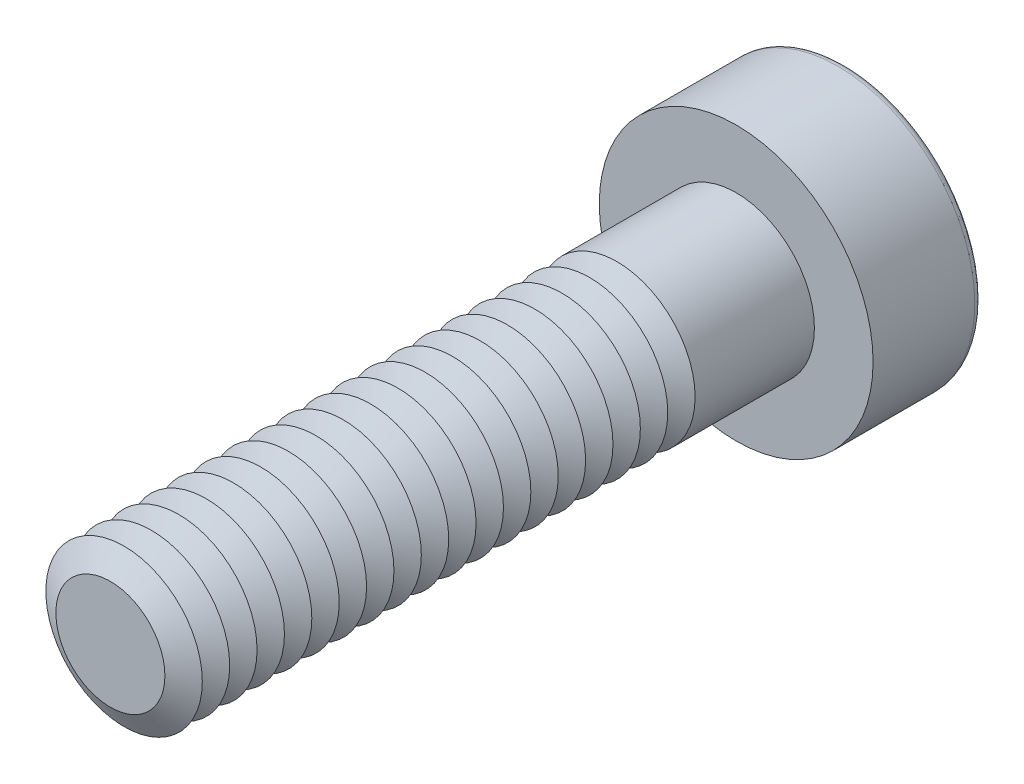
ISO-10303-21;
HEADER;
FILE_DESCRIPTION(('STEP AP214'),'2;1');
FILE_NAME('part.step','',(''),(''),'','','');
FILE_SCHEMA(('AUTOMOTIVE_DESIGN { 1 0 10303 214 1 1 1 1 }'));
ENDSEC;
DATA;
#1=APPLICATION_CONTEXT('core data for automotive mechanical design processes');
#2=APPLICATION_PROTOCOL_DEFINITION('international standard','automotive_design',2000,#1);
#3=PRODUCT_CONTEXT('',#1,'mechanical');
#4=PRODUCT('Part','Part','',(#3));
#5=PRODUCT_RELATED_PRODUCT_CATEGORY('part','',(#4));
#6=PRODUCT_DEFINITION_FORMATION('','',#4);
#7=PRODUCT_DEFINITION_CONTEXT('part definition',#1,'design');
#8=PRODUCT_DEFINITION('design','',#6,#7);
#9=PRODUCT_DEFINITION_SHAPE('','',#8);
#10=(LENGTH_UNIT() NAMED_UNIT(*) SI_UNIT(.MILLI.,.METRE.));
#11=(NAMED_UNIT(*) PLANE_ANGLE_UNIT() SI_UNIT($,.RADIAN.));
#12=(NAMED_UNIT(*) SI_UNIT($,.STERADIAN.) SOLID_ANGLE_UNIT());
#13=UNCERTAINTY_MEASURE_WITH_UNIT(LENGTH_MEASURE(1.E-05),#10,'distance_accuracy_value','');
#14=(GEOMETRIC_REPRESENTATION_CONTEXT(3) GLOBAL_UNCERTAINTY_ASSIGNED_CONTEXT((#13)) GLOBAL_UNIT_ASSIGNED_CONTEXT((#10,
#11,#12)) REPRESENTATION_CONTEXT('',''));
#15=CARTESIAN_POINT('',(0.,0.,0.));
#16=DIRECTION('',(0.,0.,1.));
#17=DIRECTION('',(1.,0.,0.));
#18=AXIS2_PLACEMENT_3D('',#15,#16,#17);
#19=CARTESIAN_POINT('',(0.,0.,13.55));
#20=DIRECTION('',(0.,0.,1.));
#21=DIRECTION('',(1.,0.,0.));
#22=AXIS2_PLACEMENT_3D('',#19,#20,#21);
#23=CONICAL_SURFACE('',#22,2.,1.0471975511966);
#24=CARTESIAN_POINT('',(0.,0.,13.2));
#25=DIRECTION('',(0.,0.,1.));
#26=DIRECTION('',(1.,0.,0.));
#27=AXIS2_PLACEMENT_3D('',#24,#25,#26);
#28=CIRCLE('',#27,1.39378221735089);
#29=CARTESIAN_POINT('',(1.39378221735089,0.,13.2));
#30=VERTEX_POINT('',#29);
#31=EDGE_CURVE('E313',#30,#30,#28,.T.);
#32=ORIENTED_EDGE('',*,*,#31,.T.);
#33=EDGE_LOOP('',(#32));
#34=FACE_BOUND('',#33,.T.);
#35=CARTESIAN_POINT('',(0.,0.,13.55));
#36=DIRECTION('',(0.,0.,1.));
#37=DIRECTION('',(1.,0.,0.));
#38=AXIS2_PLACEMENT_3D('',#35,#36,#37);
#39=CIRCLE('',#38,2.);
#40=CARTESIAN_POINT('',(2.,0.,13.55));
#41=VERTEX_POINT('',#40);
#42=EDGE_CURVE('E316',#41,#41,#39,.T.);
#43=ORIENTED_EDGE('',*,*,#42,.F.);
#44=EDGE_LOOP('',(#43));
#45=FACE_BOUND('',#44,.T.);
#46=ADVANCED_FACE('F39',(#34,#45),#23,.T.);
#47=CARTESIAN_POINT('',(0.,0.,13.2));
#48=DIRECTION('',(0.,0.,-1.));
#49=DIRECTION('',(-1.,0.,0.));
#50=AXIS2_PLACEMENT_3D('',#47,#48,#49);
#51=CONICAL_SURFACE('',#50,1.39378221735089,1.0471975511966);
#52=CARTESIAN_POINT('',(0.,0.,12.85));
#53=DIRECTION('',(0.,0.,1.));
#54=DIRECTION('',(1.,0.,0.));
#55=AXIS2_PLACEMENT_3D('',#52,#53,#54);
#56=CIRCLE('',#55,2.);
#57=CARTESIAN_POINT('',(2.,0.,12.85));
#58=VERTEX_POINT('',#57);
#59=EDGE_CURVE('E323',#58,#58,#56,.T.);
#60=ORIENTED_EDGE('',*,*,#59,.T.);
#61=EDGE_LOOP('',(#60));
#62=FACE_BOUND('',#61,.T.);
#63=ORIENTED_EDGE('',*,*,#31,.F.);
#64=EDGE_LOOP('',(#63));
#65=FACE_BOUND('',#64,.T.);
#66=ADVANCED_FACE('F245',(#62,#65),#51,.T.);
#67=CARTESIAN_POINT('',(0.,0.,16.));
#68=DIRECTION('',(0.,0.,1.));
#69=DIRECTION('',(1.,0.,0.));
#70=AXIS2_PLACEMENT_3D('',#67,#68,#69);
#71=PLANE('',#70);
#72=CARTESIAN_POINT('',(0.,0.,16.));
#73=DIRECTION('',(0.,0.,1.));
#74=DIRECTION('',(1.,0.,0.));
#75=AXIS2_PLACEMENT_3D('',#72,#73,#74);
#76=CIRCLE('',#75,1.39378221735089);
#77=CARTESIAN_POINT('',(1.39378221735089,0.,16.));
#78=VERTEX_POINT('',#77);
#79=EDGE_CURVE('E174',#78,#78,#76,.T.);
#80=ORIENTED_EDGE('',*,*,#79,.T.);
#81=EDGE_LOOP('',(#80));
#82=FACE_BOUND('',#81,.T.);
#83=ADVANCED_FACE('F251',(#82),#71,.T.);
#84=CARTESIAN_POINT('',(0.,0.,16.));
#85=DIRECTION('',(0.,0.,-1.));
#86=DIRECTION('',(-1.,0.,0.));
#87=AXIS2_PLACEMENT_3D('',#84,#85,#86);
#88=CONICAL_SURFACE('',#87,1.39378221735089,1.0471975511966);
#89=CARTESIAN_POINT('',(0.,0.,15.65));
#90=DIRECTION('',(0.,0.,1.));
#91=DIRECTION('',(1.,0.,0.));
#92=AXIS2_PLACEMENT_3D('',#89,#90,#91);
#93=CIRCLE('',#92,2.);
#94=CARTESIAN_POINT('',(2.,0.,15.65));
#95=VERTEX_POINT('',#94);
#96=EDGE_CURVE('E291',#95,#95,#93,.T.);
#97=ORIENTED_EDGE('',*,*,#96,.T.);
#98=EDGE_LOOP('',(#97));
#99=FACE_BOUND('',#98,.T.);
#100=ORIENTED_EDGE('',*,*,#79,.F.);
#101=EDGE_LOOP('',(#100));
#102=FACE_BOUND('',#101,.T.);
#103=ADVANCED_FACE('F199',(#99,#102),#88,.T.);
#104=CARTESIAN_POINT('',(0.,0.,15.65));
#105=DIRECTION('',(0.,0.,1.));
#106=DIRECTION('',(1.,0.,0.));
#107=AXIS2_PLACEMENT_3D('',#104,#105,#106);
#108=CONICAL_SURFACE('',#107,2.,1.0471975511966);
#109=CARTESIAN_POINT('',(0.,0.,15.3));
#110=DIRECTION('',(0.,0.,1.));
#111=DIRECTION('',(1.,0.,0.));
#112=AXIS2_PLACEMENT_3D('',#109,#110,#111);
#113=CIRCLE('',#112,1.39378221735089);
#114=CARTESIAN_POINT('',(1.39378221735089,0.,15.3));
#115=VERTEX_POINT('',#114);
#116=EDGE_CURVE('E288',#115,#115,#113,.T.);
#117=ORIENTED_EDGE('',*,*,#116,.T.);
#118=EDGE_LOOP('',(#117));
#119=FACE_BOUND('',#118,.T.);
#120=ORIENTED_EDGE('',*,*,#96,.F.);
#121=EDGE_LOOP('',(#120));
#122=FACE_BOUND('',#121,.T.);
#123=ADVANCED_FACE('F277',(#119,#122),#108,.T.);
#124=CARTESIAN_POINT('',(0.,0.,15.3));
#125=DIRECTION('',(0.,0.,-1.));
#126=DIRECTION('',(-1.,0.,0.));
#127=AXIS2_PLACEMENT_3D('',#124,#125,#126);
#128=CONICAL_SURFACE('',#127,1.39378221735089,1.0471975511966);
#129=CARTESIAN_POINT('',(0.,0.,14.95));
#130=DIRECTION('',(0.,0.,1.));
#131=DIRECTION('',(1.,0.,0.));
#132=AXIS2_PLACEMENT_3D('',#129,#130,#131);
#133=CIRCLE('',#132,2.);
#134=CARTESIAN_POINT('',(2.,0.,14.95));
#135=VERTEX_POINT('',#134);
#136=EDGE_CURVE('E299',#135,#135,#133,.T.);
#137=ORIENTED_EDGE('',*,*,#136,.T.);
#138=EDGE_LOOP('',(#137));
#139=FACE_BOUND('',#138,.T.);
#140=ORIENTED_EDGE('',*,*,#116,.F.);
#141=EDGE_LOOP('',(#140));
#142=FACE_BOUND('',#141,.T.);
#143=ADVANCED_FACE('F274',(#139,#142),#128,.T.);
#144=CARTESIAN_POINT('',(0.,0.,14.95));
#145=DIRECTION('',(0.,0.,1.));
#146=DIRECTION('',(1.,0.,0.));
#147=AXIS2_PLACEMENT_3D('',#144,#145,#146);
#148=CONICAL_SURFACE('',#147,2.,1.0471975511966);
#149=CARTESIAN_POINT('',(0.,0.,14.6));
#150=DIRECTION('',(0.,0.,1.));
#151=DIRECTION('',(1.,0.,0.));
#152=AXIS2_PLACEMENT_3D('',#149,#150,#151);
#153=CIRCLE('',#152,1.39378221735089);
#154=CARTESIAN_POINT('',(1.39378221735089,0.,14.6));
#155=VERTEX_POINT('',#154);
#156=EDGE_CURVE('E293',#155,#155,#153,.T.);
#157=ORIENTED_EDGE('',*,*,#156,.T.);
#158=EDGE_LOOP('',(#157));
#159=FACE_BOUND('',#158,.T.);
#160=ORIENTED_EDGE('',*,*,#136,.F.);
#161=EDGE_LOOP('',(#160));
#162=FACE_BOUND('',#161,.T.);
#163=ADVANCED_FACE('F270',(#159,#162),#148,.T.);
#164=CARTESIAN_POINT('',(0.,0.,14.6));
#165=DIRECTION('',(0.,0.,-1.));
#166=DIRECTION('',(-1.,0.,0.));
#167=AXIS2_PLACEMENT_3D('',#164,#165,#166);
#168=CONICAL_SURFACE('',#167,1.39378221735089,1.0471975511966);
#169=CARTESIAN_POINT('',(0.,0.,14.25));
#170=DIRECTION('',(0.,0.,1.));
#171=DIRECTION('',(1.,0.,0.));
#172=AXIS2_PLACEMENT_3D('',#169,#170,#171);
#173=CIRCLE('',#172,2.);
#174=CARTESIAN_POINT('',(2.,0.,14.25));
#175=VERTEX_POINT('',#174);
#176=EDGE_CURVE('E309',#175,#175,#173,.T.);
#177=ORIENTED_EDGE('',*,*,#176,.T.);
#178=EDGE_LOOP('',(#177));
#179=FACE_BOUND('',#178,.T.);
#180=ORIENTED_EDGE('',*,*,#156,.F.);
#181=EDGE_LOOP('',(#180));
#182=FACE_BOUND('',#181,.T.);
#183=ADVANCED_FACE('F266',(#179,#182),#168,.T.);
#184=CARTESIAN_POINT('',(0.,0.,14.25));
#185=DIRECTION('',(0.,0.,1.));
#186=DIRECTION('',(1.,0.,0.));
#187=AXIS2_PLACEMENT_3D('',#184,#185,#186);
#188=CONICAL_SURFACE('',#187,2.,1.0471975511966);
#189=CARTESIAN_POINT('',(0.,0.,13.9));
#190=DIRECTION('',(0.,0.,1.));
#191=DIRECTION('',(1.,0.,0.));
#192=AXIS2_PLACEMENT_3D('',#189,#190,#191);
#193=CIRCLE('',#192,1.39378221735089);
#194=CARTESIAN_POINT('',(1.39378221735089,0.,13.9));
#195=VERTEX_POINT('',#194);
#196=EDGE_CURVE('E305',#195,#195,#193,.T.);
#197=ORIENTED_EDGE('',*,*,#196,.T.);
#198=EDGE_LOOP('',(#197));
#199=FACE_BOUND('',#198,.T.);
#200=ORIENTED_EDGE('',*,*,#176,.F.);
#201=EDGE_LOOP('',(#200));
#202=FACE_BOUND('',#201,.T.);
#203=ADVANCED_FACE('F262',(#199,#202),#188,.T.);
#204=CARTESIAN_POINT('',(0.,0.,13.9));
#205=DIRECTION('',(0.,0.,-1.));
#206=DIRECTION('',(-1.,0.,0.));
#207=AXIS2_PLACEMENT_3D('',#204,#205,#206);
#208=CONICAL_SURFACE('',#207,1.39378221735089,1.0471975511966);
#209=ORIENTED_EDGE('',*,*,#42,.T.);
#210=EDGE_LOOP('',(#209));
#211=FACE_BOUND('',#210,.T.);
#212=ORIENTED_EDGE('',*,*,#196,.F.);
#213=EDGE_LOOP('',(#212));
#214=FACE_BOUND('',#213,.T.);
#215=ADVANCED_FACE('F258',(#211,#214),#208,.T.);
#216=CARTESIAN_POINT('',(0.,0.,12.85));
#217=DIRECTION('',(0.,0.,1.));
#218=DIRECTION('',(1.,0.,0.));
#219=AXIS2_PLACEMENT_3D('',#216,#217,#218);
#220=CONICAL_SURFACE('',#219,2.,1.0471975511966);
#221=CARTESIAN_POINT('',(0.,0.,12.5));
#222=DIRECTION('',(0.,0.,1.));
#223=DIRECTION('',(1.,0.,0.));
#224=AXIS2_PLACEMENT_3D('',#221,#222,#223);
#225=CIRCLE('',#224,1.39378221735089);
#226=CARTESIAN_POINT('',(1.39378221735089,0.,12.5));
#227=VERTEX_POINT('',#226);
#228=EDGE_CURVE('E319',#227,#227,#225,.T.);
#229=ORIENTED_EDGE('',*,*,#228,.T.);
#230=EDGE_LOOP('',(#229));
#231=FACE_BOUND('',#230,.T.);
#232=ORIENTED_EDGE('',*,*,#59,.F.);
#233=EDGE_LOOP('',(#232));
#234=FACE_BOUND('',#233,.T.);
#235=ADVANCED_FACE('F261',(#231,#234),#220,.T.);
#236=CARTESIAN_POINT('',(0.,0.,12.5));
#237=DIRECTION('',(0.,0.,-1.));
#238=DIRECTION('',(-1.,0.,0.));
#239=AXIS2_PLACEMENT_3D('',#236,#237,#238);
#240=CONICAL_SURFACE('',#239,1.39378221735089,1.0471975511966);
#241=CARTESIAN_POINT('',(0.,0.,12.15));
#242=DIRECTION('',(0.,0.,1.));
#243=DIRECTION('',(1.,0.,0.));
#244=AXIS2_PLACEMENT_3D('',#241,#242,#243);
#245=CIRCLE('',#244,2.);
#246=CARTESIAN_POINT('',(2.,0.,12.15));
#247=VERTEX_POINT('',#246);
#248=EDGE_CURVE('E331',#247,#247,#245,.T.);
#249=ORIENTED_EDGE('',*,*,#248,.T.);
#250=EDGE_LOOP('',(#249));
#251=FACE_BOUND('',#250,.T.);
#252=ORIENTED_EDGE('',*,*,#228,.F.);
#253=EDGE_LOOP('',(#252));
#254=FACE_BOUND('',#253,.T.);
#255=ADVANCED_FACE('F542',(#251,#254),#240,.T.);
#256=CARTESIAN_POINT('',(0.,0.,12.15));
#257=DIRECTION('',(0.,0.,1.));
#258=DIRECTION('',(1.,0.,0.));
#259=AXIS2_PLACEMENT_3D('',#256,#257,#258);
#260=CONICAL_SURFACE('',#259,2.,1.0471975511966);
#261=CARTESIAN_POINT('',(0.,0.,11.8));
#262=DIRECTION('',(0.,0.,1.));
#263=DIRECTION('',(1.,0.,0.));
#264=AXIS2_PLACEMENT_3D('',#261,#262,#263);
#265=CIRCLE('',#264,1.39378221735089);
#266=CARTESIAN_POINT('',(1.39378221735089,0.,11.8));
#267=VERTEX_POINT('',#266);
#268=EDGE_CURVE('E327',#267,#267,#265,.T.);
#269=ORIENTED_EDGE('',*,*,#268,.T.);
#270=EDGE_LOOP('',(#269));
#271=FACE_BOUND('',#270,.T.);
#272=ORIENTED_EDGE('',*,*,#248,.F.);
#273=EDGE_LOOP('',(#272));
#274=FACE_BOUND('',#273,.T.);
#275=ADVANCED_FACE('F538',(#271,#274),#260,.T.);
#276=CARTESIAN_POINT('',(0.,0.,11.8));
#277=DIRECTION('',(0.,0.,-1.));
#278=DIRECTION('',(-1.,0.,0.));
#279=AXIS2_PLACEMENT_3D('',#276,#277,#278);
#280=CONICAL_SURFACE('',#279,1.39378221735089,1.0471975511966);
#281=CARTESIAN_POINT('',(0.,0.,11.45));
#282=DIRECTION('',(0.,0.,1.));
#283=DIRECTION('',(1.,0.,0.));
#284=AXIS2_PLACEMENT_3D('',#281,#282,#283);
#285=CIRCLE('',#284,2.);
#286=CARTESIAN_POINT('',(2.,0.,11.45));
#287=VERTEX_POINT('',#286);
#288=EDGE_CURVE('E338',#287,#287,#285,.T.);
#289=ORIENTED_EDGE('',*,*,#288,.T.);
#290=EDGE_LOOP('',(#289));
#291=FACE_BOUND('',#290,.T.);
#292=ORIENTED_EDGE('',*,*,#268,.F.);
#293=EDGE_LOOP('',(#292));
#294=FACE_BOUND('',#293,.T.);
#295=ADVANCED_FACE('F534',(#291,#294),#280,.T.);
#296=CARTESIAN_POINT('',(0.,0.,11.45));
#297=DIRECTION('',(0.,0.,1.));
#298=DIRECTION('',(1.,0.,0.));
#299=AXIS2_PLACEMENT_3D('',#296,#297,#298);
#300=CONICAL_SURFACE('',#299,2.,1.0471975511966);
#301=CARTESIAN_POINT('',(0.,0.,11.1));
#302=DIRECTION('',(0.,0.,1.));
#303=DIRECTION('',(1.,0.,0.));
#304=AXIS2_PLACEMENT_3D('',#301,#302,#303);
#305=CIRCLE('',#304,1.39378221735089);
#306=CARTESIAN_POINT('',(1.39378221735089,0.,11.1));
#307=VERTEX_POINT('',#306);
#308=EDGE_CURVE('E335',#307,#307,#305,.T.);
#309=ORIENTED_EDGE('',*,*,#308,.T.);
#310=EDGE_LOOP('',(#309));
#311=FACE_BOUND('',#310,.T.);
#312=ORIENTED_EDGE('',*,*,#288,.F.);
#313=EDGE_LOOP('',(#312));
#314=FACE_BOUND('',#313,.T.);
#315=ADVANCED_FACE('F530',(#311,#314),#300,.T.);
#316=CARTESIAN_POINT('',(0.,0.,11.1));
#317=DIRECTION('',(0.,0.,-1.));
#318=DIRECTION('',(-1.,0.,0.));
#319=AXIS2_PLACEMENT_3D('',#316,#317,#318);
#320=CONICAL_SURFACE('',#319,1.39378221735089,1.0471975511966);
#321=CARTESIAN_POINT('',(0.,0.,10.75));
#322=DIRECTION('',(0.,0.,1.));
#323=DIRECTION('',(1.,0.,0.));
#324=AXIS2_PLACEMENT_3D('',#321,#322,#323);
#325=CIRCLE('',#324,2.);
#326=CARTESIAN_POINT('',(2.,0.,10.75));
#327=VERTEX_POINT('',#326);
#328=EDGE_CURVE('E345',#327,#327,#325,.T.);
#329=ORIENTED_EDGE('',*,*,#328,.T.);
#330=EDGE_LOOP('',(#329));
#331=FACE_BOUND('',#330,.T.);
#332=ORIENTED_EDGE('',*,*,#308,.F.);
#333=EDGE_LOOP('',(#332));
#334=FACE_BOUND('',#333,.T.);
#335=ADVANCED_FACE('F526',(#331,#334),#320,.T.);
#336=CARTESIAN_POINT('',(0.,0.,10.75));
#337=DIRECTION('',(0.,0.,1.));
#338=DIRECTION('',(1.,0.,0.));
#339=AXIS2_PLACEMENT_3D('',#336,#337,#338);
#340=CONICAL_SURFACE('',#339,2.,1.0471975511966);
#341=CARTESIAN_POINT('',(0.,0.,10.4));
#342=DIRECTION('',(0.,0.,1.));
#343=DIRECTION('',(1.,0.,0.));
#344=AXIS2_PLACEMENT_3D('',#341,#342,#343);
#345=CIRCLE('',#344,1.39378221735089);
#346=CARTESIAN_POINT('',(1.39378221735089,0.,10.4));
#347=VERTEX_POINT('',#346);
#348=EDGE_CURVE('E341',#347,#347,#345,.T.);
#349=ORIENTED_EDGE('',*,*,#348,.T.);
#350=EDGE_LOOP('',(#349));
#351=FACE_BOUND('',#350,.T.);
#352=ORIENTED_EDGE('',*,*,#328,.F.);
#353=EDGE_LOOP('',(#352));
#354=FACE_BOUND('',#353,.T.);
#355=ADVANCED_FACE('F522',(#351,#354),#340,.T.);
#356=CARTESIAN_POINT('',(0.,0.,10.4));
#357=DIRECTION('',(0.,0.,-1.));
#358=DIRECTION('',(-1.,0.,0.));
#359=AXIS2_PLACEMENT_3D('',#356,#357,#358);
#360=CONICAL_SURFACE('',#359,1.39378221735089,1.0471975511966);
#361=CARTESIAN_POINT('',(0.,0.,10.05));
#362=DIRECTION('',(0.,0.,1.));
#363=DIRECTION('',(1.,0.,0.));
#364=AXIS2_PLACEMENT_3D('',#361,#362,#363);
#365=CIRCLE('',#364,2.);
#366=CARTESIAN_POINT('',(2.,0.,10.05));
#367=VERTEX_POINT('',#366);
#368=EDGE_CURVE('E353',#367,#367,#365,.T.);
#369=ORIENTED_EDGE('',*,*,#368,.T.);
#370=EDGE_LOOP('',(#369));
#371=FACE_BOUND('',#370,.T.);
#372=ORIENTED_EDGE('',*,*,#348,.F.);
#373=EDGE_LOOP('',(#372));
#374=FACE_BOUND('',#373,.T.);
#375=ADVANCED_FACE('F518',(#371,#374),#360,.T.);
#376=CARTESIAN_POINT('',(0.,0.,10.05));
#377=DIRECTION('',(0.,0.,1.));
#378=DIRECTION('',(1.,0.,0.));
#379=AXIS2_PLACEMENT_3D('',#376,#377,#378);
#380=CONICAL_SURFACE('',#379,2.,1.0471975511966);
#381=CARTESIAN_POINT('',(0.,0.,9.7));
#382=DIRECTION('',(0.,0.,1.));
#383=DIRECTION('',(1.,0.,0.));
#384=AXIS2_PLACEMENT_3D('',#381,#382,#383);
#385=CIRCLE('',#384,1.39378221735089);
#386=CARTESIAN_POINT('',(1.39378221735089,0.,9.7));
#387=VERTEX_POINT('',#386);
#388=EDGE_CURVE('E349',#387,#387,#385,.T.);
#389=ORIENTED_EDGE('',*,*,#388,.T.);
#390=EDGE_LOOP('',(#389));
#391=FACE_BOUND('',#390,.T.);
#392=ORIENTED_EDGE('',*,*,#368,.F.);
#393=EDGE_LOOP('',(#392));
#394=FACE_BOUND('',#393,.T.);
#395=ADVANCED_FACE('F514',(#391,#394),#380,.T.);
#396=CARTESIAN_POINT('',(0.,0.,9.7));
#397=DIRECTION('',(0.,0.,-1.));
#398=DIRECTION('',(-1.,0.,0.));
#399=AXIS2_PLACEMENT_3D('',#396,#397,#398);
#400=CONICAL_SURFACE('',#399,1.39378221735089,1.0471975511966);
#401=CARTESIAN_POINT('',(0.,0.,9.35));
#402=DIRECTION('',(0.,0.,1.));
#403=DIRECTION('',(1.,0.,0.));
#404=AXIS2_PLACEMENT_3D('',#401,#402,#403);
#405=CIRCLE('',#404,2.);
#406=CARTESIAN_POINT('',(2.,0.,9.35));
#407=VERTEX_POINT('',#406);
#408=EDGE_CURVE('E361',#407,#407,#405,.T.);
#409=ORIENTED_EDGE('',*,*,#408,.T.);
#410=EDGE_LOOP('',(#409));
#411=FACE_BOUND('',#410,.T.);
#412=ORIENTED_EDGE('',*,*,#388,.F.);
#413=EDGE_LOOP('',(#412));
#414=FACE_BOUND('',#413,.T.);
#415=ADVANCED_FACE('F510',(#411,#414),#400,.T.);
#416=CARTESIAN_POINT('',(0.,0.,9.35));
#417=DIRECTION('',(0.,0.,1.));
#418=DIRECTION('',(1.,0.,0.));
#419=AXIS2_PLACEMENT_3D('',#416,#417,#418);
#420=CONICAL_SURFACE('',#419,2.,1.0471975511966);
#421=CARTESIAN_POINT('',(0.,0.,9.));
#422=DIRECTION('',(0.,0.,1.));
#423=DIRECTION('',(1.,0.,0.));
#424=AXIS2_PLACEMENT_3D('',#421,#422,#423);
#425=CIRCLE('',#424,1.39378221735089);
#426=CARTESIAN_POINT('',(1.39378221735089,0.,9.));
#427=VERTEX_POINT('',#426);
#428=EDGE_CURVE('E357',#427,#427,#425,.T.);
#429=ORIENTED_EDGE('',*,*,#428,.T.);
#430=EDGE_LOOP('',(#429));
#431=FACE_BOUND('',#430,.T.);
#432=ORIENTED_EDGE('',*,*,#408,.F.);
#433=EDGE_LOOP('',(#432));
#434=FACE_BOUND('',#433,.T.);
#435=ADVANCED_FACE('F506',(#431,#434),#420,.T.);
#436=CARTESIAN_POINT('',(0.,0.,9.));
#437=DIRECTION('',(0.,0.,-1.));
#438=DIRECTION('',(-1.,0.,0.));
#439=AXIS2_PLACEMENT_3D('',#436,#437,#438);
#440=CONICAL_SURFACE('',#439,1.39378221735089,1.0471975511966);
#441=CARTESIAN_POINT('',(0.,0.,8.65));
#442=DIRECTION('',(0.,0.,1.));
#443=DIRECTION('',(1.,0.,0.));
#444=AXIS2_PLACEMENT_3D('',#441,#442,#443);
#445=CIRCLE('',#444,2.);
#446=CARTESIAN_POINT('',(2.,0.,8.65));
#447=VERTEX_POINT('',#446);
#448=EDGE_CURVE('E369',#447,#447,#445,.T.);
#449=ORIENTED_EDGE('',*,*,#448,.T.);
#450=EDGE_LOOP('',(#449));
#451=FACE_BOUND('',#450,.T.);
#452=ORIENTED_EDGE('',*,*,#428,.F.);
#453=EDGE_LOOP('',(#452));
#454=FACE_BOUND('',#453,.T.);
#455=ADVANCED_FACE('F502',(#451,#454),#440,.T.);
#456=CARTESIAN_POINT('',(0.,0.,8.65));
#457=DIRECTION('',(0.,0.,1.));
#458=DIRECTION('',(1.,0.,0.));
#459=AXIS2_PLACEMENT_3D('',#456,#457,#458);
#460=CONICAL_SURFACE('',#459,2.,1.0471975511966);
#461=CARTESIAN_POINT('',(0.,0.,8.3));
#462=DIRECTION('',(0.,0.,1.));
#463=DIRECTION('',(1.,0.,0.));
#464=AXIS2_PLACEMENT_3D('',#461,#462,#463);
#465=CIRCLE('',#464,1.39378221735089);
#466=CARTESIAN_POINT('',(1.39378221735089,0.,8.3));
#467=VERTEX_POINT('',#466);
#468=EDGE_CURVE('E365',#467,#467,#465,.T.);
#469=ORIENTED_EDGE('',*,*,#468,.T.);
#470=EDGE_LOOP('',(#469));
#471=FACE_BOUND('',#470,.T.);
#472=ORIENTED_EDGE('',*,*,#448,.F.);
#473=EDGE_LOOP('',(#472));
#474=FACE_BOUND('',#473,.T.);
#475=ADVANCED_FACE('F498',(#471,#474),#460,.T.);
#476=CARTESIAN_POINT('',(0.,0.,8.3));
#477=DIRECTION('',(0.,0.,-1.));
#478=DIRECTION('',(-1.,0.,0.));
#479=AXIS2_PLACEMENT_3D('',#476,#477,#478);
#480=CONICAL_SURFACE('',#479,1.39378221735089,1.0471975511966);
#481=CARTESIAN_POINT('',(0.,0.,7.95));
#482=DIRECTION('',(0.,0.,1.));
#483=DIRECTION('',(1.,0.,0.));
#484=AXIS2_PLACEMENT_3D('',#481,#482,#483);
#485=CIRCLE('',#484,2.);
#486=CARTESIAN_POINT('',(2.,0.,7.95));
#487=VERTEX_POINT('',#486);
#488=EDGE_CURVE('E377',#487,#487,#485,.T.);
#489=ORIENTED_EDGE('',*,*,#488,.T.);
#490=EDGE_LOOP('',(#489));
#491=FACE_BOUND('',#490,.T.);
#492=ORIENTED_EDGE('',*,*,#468,.F.);
#493=EDGE_LOOP('',(#492));
#494=FACE_BOUND('',#493,.T.);
#495=ADVANCED_FACE('F494',(#491,#494),#480,.T.);
#496=CARTESIAN_POINT('',(0.,0.,7.95));
#497=DIRECTION('',(0.,0.,1.));
#498=DIRECTION('',(1.,0.,0.));
#499=AXIS2_PLACEMENT_3D('',#496,#497,#498);
#500=CONICAL_SURFACE('',#499,2.,1.0471975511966);
#501=CARTESIAN_POINT('',(0.,0.,7.6));
#502=DIRECTION('',(0.,0.,1.));
#503=DIRECTION('',(1.,0.,0.));
#504=AXIS2_PLACEMENT_3D('',#501,#502,#503);
#505=CIRCLE('',#504,1.39378221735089);
#506=CARTESIAN_POINT('',(1.39378221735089,0.,7.6));
#507=VERTEX_POINT('',#506);
#508=EDGE_CURVE('E373',#507,#507,#505,.T.);
#509=ORIENTED_EDGE('',*,*,#508,.T.);
#510=EDGE_LOOP('',(#509));
#511=FACE_BOUND('',#510,.T.);
#512=ORIENTED_EDGE('',*,*,#488,.F.);
#513=EDGE_LOOP('',(#512));
#514=FACE_BOUND('',#513,.T.);
#515=ADVANCED_FACE('F490',(#511,#514),#500,.T.);
#516=CARTESIAN_POINT('',(0.,0.,7.6));
#517=DIRECTION('',(0.,0.,-1.));
#518=DIRECTION('',(-1.,0.,0.));
#519=AXIS2_PLACEMENT_3D('',#516,#517,#518);
#520=CONICAL_SURFACE('',#519,1.39378221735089,1.0471975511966);
#521=CARTESIAN_POINT('',(0.,0.,7.25));
#522=DIRECTION('',(0.,0.,1.));
#523=DIRECTION('',(1.,0.,0.));
#524=AXIS2_PLACEMENT_3D('',#521,#522,#523);
#525=CIRCLE('',#524,2.);
#526=CARTESIAN_POINT('',(2.,0.,7.25));
#527=VERTEX_POINT('',#526);
#528=EDGE_CURVE('E385',#527,#527,#525,.T.);
#529=ORIENTED_EDGE('',*,*,#528,.T.);
#530=EDGE_LOOP('',(#529));
#531=FACE_BOUND('',#530,.T.);
#532=ORIENTED_EDGE('',*,*,#508,.F.);
#533=EDGE_LOOP('',(#532));
#534=FACE_BOUND('',#533,.T.);
#535=ADVANCED_FACE('F486',(#531,#534),#520,.T.);
#536=CARTESIAN_POINT('',(0.,0.,7.25));
#537=DIRECTION('',(0.,0.,1.));
#538=DIRECTION('',(1.,0.,0.));
#539=AXIS2_PLACEMENT_3D('',#536,#537,#538);
#540=CONICAL_SURFACE('',#539,2.,1.0471975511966);
#541=CARTESIAN_POINT('',(0.,0.,6.9));
#542=DIRECTION('',(0.,0.,1.));
#543=DIRECTION('',(1.,0.,0.));
#544=AXIS2_PLACEMENT_3D('',#541,#542,#543);
#545=CIRCLE('',#544,1.39378221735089);
#546=CARTESIAN_POINT('',(1.39378221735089,0.,6.9));
#547=VERTEX_POINT('',#546);
#548=EDGE_CURVE('E381',#547,#547,#545,.T.);
#549=ORIENTED_EDGE('',*,*,#548,.T.);
#550=EDGE_LOOP('',(#549));
#551=FACE_BOUND('',#550,.T.);
#552=ORIENTED_EDGE('',*,*,#528,.F.);
#553=EDGE_LOOP('',(#552));
#554=FACE_BOUND('',#553,.T.);
#555=ADVANCED_FACE('F482',(#551,#554),#540,.T.);
#556=CARTESIAN_POINT('',(0.,0.,6.9));
#557=DIRECTION('',(0.,0.,-1.));
#558=DIRECTION('',(-1.,0.,0.));
#559=AXIS2_PLACEMENT_3D('',#556,#557,#558);
#560=CONICAL_SURFACE('',#559,1.39378221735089,1.0471975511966);
#561=CARTESIAN_POINT('',(0.,0.,6.55));
#562=DIRECTION('',(0.,0.,1.));
#563=DIRECTION('',(1.,0.,0.));
#564=AXIS2_PLACEMENT_3D('',#561,#562,#563);
#565=CIRCLE('',#564,2.);
#566=CARTESIAN_POINT('',(2.,0.,6.55));
#567=VERTEX_POINT('',#566);
#568=EDGE_CURVE('E393',#567,#567,#565,.T.);
#569=ORIENTED_EDGE('',*,*,#568,.T.);
#570=EDGE_LOOP('',(#569));
#571=FACE_BOUND('',#570,.T.);
#572=ORIENTED_EDGE('',*,*,#548,.F.);
#573=EDGE_LOOP('',(#572));
#574=FACE_BOUND('',#573,.T.);
#575=ADVANCED_FACE('F478',(#571,#574),#560,.T.);
#576=CARTESIAN_POINT('',(0.,0.,6.55));
#577=DIRECTION('',(0.,0.,1.));
#578=DIRECTION('',(1.,0.,0.));
#579=AXIS2_PLACEMENT_3D('',#576,#577,#578);
#580=CONICAL_SURFACE('',#579,2.,1.0471975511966);
#581=CARTESIAN_POINT('',(0.,0.,6.2));
#582=DIRECTION('',(0.,0.,1.));
#583=DIRECTION('',(1.,0.,0.));
#584=AXIS2_PLACEMENT_3D('',#581,#582,#583);
#585=CIRCLE('',#584,1.39378221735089);
#586=CARTESIAN_POINT('',(1.39378221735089,0.,6.2));
#587=VERTEX_POINT('',#586);
#588=EDGE_CURVE('E389',#587,#587,#585,.T.);
#589=ORIENTED_EDGE('',*,*,#588,.T.);
#590=EDGE_LOOP('',(#589));
#591=FACE_BOUND('',#590,.T.);
#592=ORIENTED_EDGE('',*,*,#568,.F.);
#593=EDGE_LOOP('',(#592));
#594=FACE_BOUND('',#593,.T.);
#595=ADVANCED_FACE('F474',(#591,#594),#580,.T.);
#596=CARTESIAN_POINT('',(0.,0.,6.2));
#597=DIRECTION('',(0.,0.,-1.));
#598=DIRECTION('',(-1.,0.,0.));
#599=AXIS2_PLACEMENT_3D('',#596,#597,#598);
#600=CONICAL_SURFACE('',#599,1.39378221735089,1.0471975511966);
#601=CARTESIAN_POINT('',(0.,0.,5.85));
#602=DIRECTION('',(0.,0.,1.));
#603=DIRECTION('',(1.,0.,0.));
#604=AXIS2_PLACEMENT_3D('',#601,#602,#603);
#605=CIRCLE('',#604,2.);
#606=CARTESIAN_POINT('',(2.,0.,5.85));
#607=VERTEX_POINT('',#606);
#608=EDGE_CURVE('E401',#607,#607,#605,.T.);
#609=ORIENTED_EDGE('',*,*,#608,.T.);
#610=EDGE_LOOP('',(#609));
#611=FACE_BOUND('',#610,.T.);
#612=ORIENTED_EDGE('',*,*,#588,.F.);
#613=EDGE_LOOP('',(#612));
#614=FACE_BOUND('',#613,.T.);
#615=ADVANCED_FACE('F470',(#611,#614),#600,.T.);
#616=CARTESIAN_POINT('',(0.,0.,5.85));
#617=DIRECTION('',(0.,0.,1.));
#618=DIRECTION('',(1.,0.,0.));
#619=AXIS2_PLACEMENT_3D('',#616,#617,#618);
#620=CONICAL_SURFACE('',#619,2.,1.0471975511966);
#621=CARTESIAN_POINT('',(0.,0.,5.5));
#622=DIRECTION('',(0.,0.,1.));
#623=DIRECTION('',(1.,0.,0.));
#624=AXIS2_PLACEMENT_3D('',#621,#622,#623);
#625=CIRCLE('',#624,1.39378221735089);
#626=CARTESIAN_POINT('',(1.39378221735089,0.,5.5));
#627=VERTEX_POINT('',#626);
#628=EDGE_CURVE('E397',#627,#627,#625,.T.);
#629=ORIENTED_EDGE('',*,*,#628,.T.);
#630=EDGE_LOOP('',(#629));
#631=FACE_BOUND('',#630,.T.);
#632=ORIENTED_EDGE('',*,*,#608,.F.);
#633=EDGE_LOOP('',(#632));
#634=FACE_BOUND('',#633,.T.);
#635=ADVANCED_FACE('F466',(#631,#634),#620,.T.);
#636=CARTESIAN_POINT('',(0.,0.,5.5));
#637=DIRECTION('',(0.,0.,-1.));
#638=DIRECTION('',(-1.,0.,0.));
#639=AXIS2_PLACEMENT_3D('',#636,#637,#638);
#640=CONICAL_SURFACE('',#639,1.39378221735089,1.0471975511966);
#641=CARTESIAN_POINT('',(0.,0.,5.15));
#642=DIRECTION('',(0.,0.,1.));
#643=DIRECTION('',(1.,0.,0.));
#644=AXIS2_PLACEMENT_3D('',#641,#642,#643);
#645=CIRCLE('',#644,2.);
#646=CARTESIAN_POINT('',(2.,0.,5.15));
#647=VERTEX_POINT('',#646);
#648=EDGE_CURVE('E409',#647,#647,#645,.T.);
#649=ORIENTED_EDGE('',*,*,#648,.T.);
#650=EDGE_LOOP('',(#649));
#651=FACE_BOUND('',#650,.T.);
#652=ORIENTED_EDGE('',*,*,#628,.F.);
#653=EDGE_LOOP('',(#652));
#654=FACE_BOUND('',#653,.T.);
#655=ADVANCED_FACE('F462',(#651,#654),#640,.T.);
#656=CARTESIAN_POINT('',(0.,0.,5.15));
#657=DIRECTION('',(0.,0.,1.));
#658=DIRECTION('',(1.,0.,0.));
#659=AXIS2_PLACEMENT_3D('',#656,#657,#658);
#660=CONICAL_SURFACE('',#659,2.,1.0471975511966);
#661=CARTESIAN_POINT('',(0.,0.,4.8));
#662=DIRECTION('',(0.,0.,1.));
#663=DIRECTION('',(1.,0.,0.));
#664=AXIS2_PLACEMENT_3D('',#661,#662,#663);
#665=CIRCLE('',#664,1.39378221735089);
#666=CARTESIAN_POINT('',(1.39378221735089,0.,4.8));
#667=VERTEX_POINT('',#666);
#668=EDGE_CURVE('E405',#667,#667,#665,.T.);
#669=ORIENTED_EDGE('',*,*,#668,.T.);
#670=EDGE_LOOP('',(#669));
#671=FACE_BOUND('',#670,.T.);
#672=ORIENTED_EDGE('',*,*,#648,.F.);
#673=EDGE_LOOP('',(#672));
#674=FACE_BOUND('',#673,.T.);
#675=ADVANCED_FACE('F458',(#671,#674),#660,.T.);
#676=CARTESIAN_POINT('',(0.,0.,4.8));
#677=DIRECTION('',(0.,0.,-1.));
#678=DIRECTION('',(-1.,0.,0.));
#679=AXIS2_PLACEMENT_3D('',#676,#677,#678);
#680=CONICAL_SURFACE('',#679,1.39378221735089,1.0471975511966);
#681=CARTESIAN_POINT('',(0.,0.,4.45));
#682=DIRECTION('',(0.,0.,1.));
#683=DIRECTION('',(1.,0.,0.));
#684=AXIS2_PLACEMENT_3D('',#681,#682,#683);
#685=CIRCLE('',#684,2.);
#686=CARTESIAN_POINT('',(2.,0.,4.45));
#687=VERTEX_POINT('',#686);
#688=EDGE_CURVE('E417',#687,#687,#685,.T.);
#689=ORIENTED_EDGE('',*,*,#688,.T.);
#690=EDGE_LOOP('',(#689));
#691=FACE_BOUND('',#690,.T.);
#692=ORIENTED_EDGE('',*,*,#668,.F.);
#693=EDGE_LOOP('',(#692));
#694=FACE_BOUND('',#693,.T.);
#695=ADVANCED_FACE('F454',(#691,#694),#680,.T.);
#696=CARTESIAN_POINT('',(0.,0.,4.45));
#697=DIRECTION('',(0.,0.,1.));
#698=DIRECTION('',(1.,0.,0.));
#699=AXIS2_PLACEMENT_3D('',#696,#697,#698);
#700=CONICAL_SURFACE('',#699,2.,1.0471975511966);
#701=CARTESIAN_POINT('',(0.,0.,4.1));
#702=DIRECTION('',(0.,0.,1.));
#703=DIRECTION('',(1.,0.,0.));
#704=AXIS2_PLACEMENT_3D('',#701,#702,#703);
#705=CIRCLE('',#704,1.39378221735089);
#706=CARTESIAN_POINT('',(1.39378221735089,0.,4.1));
#707=VERTEX_POINT('',#706);
#708=EDGE_CURVE('E413',#707,#707,#705,.T.);
#709=ORIENTED_EDGE('',*,*,#708,.T.);
#710=EDGE_LOOP('',(#709));
#711=FACE_BOUND('',#710,.T.);
#712=ORIENTED_EDGE('',*,*,#688,.F.);
#713=EDGE_LOOP('',(#712));
#714=FACE_BOUND('',#713,.T.);
#715=ADVANCED_FACE('F449',(#711,#714),#700,.T.);
#716=CARTESIAN_POINT('',(0.,0.,4.1));
#717=DIRECTION('',(0.,0.,-1.));
#718=DIRECTION('',(-1.,0.,0.));
#719=AXIS2_PLACEMENT_3D('',#716,#717,#718);
#720=CONICAL_SURFACE('',#719,1.39378221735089,1.0471975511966);
#721=CARTESIAN_POINT('',(0.,0.,3.75));
#722=DIRECTION('',(0.,0.,1.));
#723=DIRECTION('',(1.,0.,0.));
#724=AXIS2_PLACEMENT_3D('',#721,#722,#723);
#725=CIRCLE('',#724,2.);
#726=CARTESIAN_POINT('',(2.,0.,3.75));
#727=VERTEX_POINT('',#726);
#728=EDGE_CURVE('E429',#727,#727,#725,.T.);
#729=ORIENTED_EDGE('',*,*,#728,.T.);
#730=EDGE_LOOP('',(#729));
#731=FACE_BOUND('',#730,.T.);
#732=ORIENTED_EDGE('',*,*,#708,.F.);
#733=EDGE_LOOP('',(#732));
#734=FACE_BOUND('',#733,.T.);
#735=ADVANCED_FACE('F435',(#731,#734),#720,.T.);
#736=CARTESIAN_POINT('',(0.,0.,3.75));
#737=DIRECTION('',(0.,0.,1.));
#738=DIRECTION('',(1.,0.,0.));
#739=AXIS2_PLACEMENT_3D('',#736,#737,#738);
#740=CONICAL_SURFACE('',#739,2.,1.0471975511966);
#741=CARTESIAN_POINT('',(0.,0.,3.4));
#742=DIRECTION('',(0.,0.,1.));
#743=DIRECTION('',(1.,0.,0.));
#744=AXIS2_PLACEMENT_3D('',#741,#742,#743);
#745=CIRCLE('',#744,1.39378221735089);
#746=CARTESIAN_POINT('',(1.39378221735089,0.,3.4));
#747=VERTEX_POINT('',#746);
#748=EDGE_CURVE('E421',#747,#747,#745,.T.);
#749=ORIENTED_EDGE('',*,*,#748,.T.);
#750=EDGE_LOOP('',(#749));
#751=FACE_BOUND('',#750,.T.);
#752=ORIENTED_EDGE('',*,*,#728,.F.);
#753=EDGE_LOOP('',(#752));
#754=FACE_BOUND('',#753,.T.);
#755=ADVANCED_FACE('F438',(#751,#754),#740,.T.);
#756=CARTESIAN_POINT('',(0.,0.,3.4));
#757=DIRECTION('',(0.,0.,-1.));
#758=DIRECTION('',(-1.,0.,0.));
#759=AXIS2_PLACEMENT_3D('',#756,#757,#758);
#760=CONICAL_SURFACE('',#759,1.39378221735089,1.0471975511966);
#761=CARTESIAN_POINT('',(0.,0.,3.05));
#762=DIRECTION('',(0.,0.,1.));
#763=DIRECTION('',(1.,0.,0.));
#764=AXIS2_PLACEMENT_3D('',#761,#762,#763);
#765=CIRCLE('',#764,2.);
#766=CARTESIAN_POINT('',(2.,0.,3.05));
#767=VERTEX_POINT('',#766);
#768=EDGE_CURVE('E425',#767,#767,#765,.T.);
#769=ORIENTED_EDGE('',*,*,#768,.T.);
#770=EDGE_LOOP('',(#769));
#771=FACE_BOUND('',#770,.T.);
#772=ORIENTED_EDGE('',*,*,#748,.F.);
#773=EDGE_LOOP('',(#772));
#774=FACE_BOUND('',#773,.T.);
#775=ADVANCED_FACE('F440',(#771,#774),#760,.T.);
#776=CARTESIAN_POINT('',(0.,0.,-0.925));
#777=DIRECTION('',(0.,0.,-1.));
#778=DIRECTION('',(-1.,0.,0.));
#779=AXIS2_PLACEMENT_3D('',#776,#777,#778);
#780=CONICAL_SURFACE('',#779,1.25,1.0471975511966);
#781=CARTESIAN_POINT('',(0.,0.,-0.203312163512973));
#782=VERTEX_POINT('',#781);
#783=VERTEX_LOOP('',#782);
#784=FACE_BOUND('',#783,.T.);
#785=CARTESIAN_POINT('',(0.,0.,-0.925));
#786=DIRECTION('',(0.,0.,-1.));
#787=DIRECTION('',(-1.,0.,0.));
#788=AXIS2_PLACEMENT_3D('',#785,#786,#787);
#789=CIRCLE('',#788,1.25);
#790=CARTESIAN_POINT('',(-1.08253175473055,0.624999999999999,-0.925));
#791=VERTEX_POINT('',#790);
#792=CARTESIAN_POINT('',(0.,1.25,-0.925));
#793=VERTEX_POINT('',#792);
#794=EDGE_CURVE('E149',#791,#793,#789,.T.);
#795=ORIENTED_EDGE('',*,*,#794,.T.);
#796=CARTESIAN_POINT('',(0.,0.,-0.925));
#797=DIRECTION('',(0.,0.,-1.));
#798=DIRECTION('',(-1.,0.,0.));
#799=AXIS2_PLACEMENT_3D('',#796,#797,#798);
#800=CIRCLE('',#799,1.25);
#801=CARTESIAN_POINT('',(1.08253175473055,0.625,-0.925));
#802=VERTEX_POINT('',#801);
#803=EDGE_CURVE('E54',#793,#802,#800,.T.);
#804=ORIENTED_EDGE('',*,*,#803,.T.);
#805=CARTESIAN_POINT('',(1.08253175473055,-0.624999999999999,-0.925));
#806=VERTEX_POINT('',#805);
#807=EDGE_CURVE('E1084',#802,#806,#800,.T.);
#808=ORIENTED_EDGE('',*,*,#807,.T.);
#809=CARTESIAN_POINT('',(0.,-1.25,-0.925));
#810=VERTEX_POINT('',#809);
#811=EDGE_CURVE('E1082',#806,#810,#800,.T.);
#812=ORIENTED_EDGE('',*,*,#811,.T.);
#813=CARTESIAN_POINT('',(-1.08253175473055,-0.624999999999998,-0.925));
#814=VERTEX_POINT('',#813);
#815=EDGE_CURVE('E1077',#810,#814,#800,.T.);
#816=ORIENTED_EDGE('',*,*,#815,.T.);
#817=EDGE_CURVE('E1075',#814,#791,#800,.T.);
#818=ORIENTED_EDGE('',*,*,#817,.T.);
#819=EDGE_LOOP('',(#795,#804,#808,#812,#816,#818));
#820=FACE_BOUND('',#819,.T.);
#821=ADVANCED_FACE('F201',(#784,#820),#780,.F.);
#822=CARTESIAN_POINT('',(0.,0.,-0.925));
#823=DIRECTION('',(0.,0.,-1.));
#824=DIRECTION('',(-1.,0.,0.));
#825=AXIS2_PLACEMENT_3D('',#822,#823,#824);
#826=PLANE('',#825);
#827=ORIENTED_EDGE('',*,*,#803,.F.);
#828=DIRECTION('',(1.,0.,0.));
#829=VECTOR('',#828,1.);
#830=CARTESIAN_POINT('',(-0.721687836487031,1.25,-0.925));
#831=LINE('',#830,#829);
#832=CARTESIAN_POINT('',(0.721687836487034,1.25,-0.925));
#833=VERTEX_POINT('',#832);
#834=EDGE_CURVE('E1128',#793,#833,#831,.T.);
#835=ORIENTED_EDGE('',*,*,#834,.T.);
#836=DIRECTION('',(0.5,-0.866025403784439,0.));
#837=VECTOR('',#836,1.);
#838=CARTESIAN_POINT('',(0.721687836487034,1.25,-0.925));
#839=LINE('',#838,#837);
#840=EDGE_CURVE('E155',#833,#802,#839,.T.);
#841=ORIENTED_EDGE('',*,*,#840,.T.);
#842=EDGE_LOOP('',(#827,#835,#841));
#843=FACE_BOUND('',#842,.T.);
#844=ADVANCED_FACE('F649',(#843),#826,.T.);
#845=ORIENTED_EDGE('',*,*,#807,.F.);
#846=CARTESIAN_POINT('',(1.44337567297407,0.,-0.925));
#847=VERTEX_POINT('',#846);
#848=EDGE_CURVE('E1124',#802,#847,#839,.T.);
#849=ORIENTED_EDGE('',*,*,#848,.T.);
#850=DIRECTION('',(-0.5,-0.866025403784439,0.));
#851=VECTOR('',#850,1.);
#852=CARTESIAN_POINT('',(1.44337567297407,0.,-0.925));
#853=LINE('',#852,#851);
#854=EDGE_CURVE('E1099',#847,#806,#853,.T.);
#855=ORIENTED_EDGE('',*,*,#854,.T.);
#856=EDGE_LOOP('',(#845,#849,#855));
#857=FACE_BOUND('',#856,.T.);
#858=ADVANCED_FACE('F659',(#857),#826,.T.);
#859=ORIENTED_EDGE('',*,*,#811,.F.);
#860=CARTESIAN_POINT('',(0.721687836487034,-1.25,-0.925));
#861=VERTEX_POINT('',#860);
#862=EDGE_CURVE('E1101',#806,#861,#853,.T.);
#863=ORIENTED_EDGE('',*,*,#862,.T.);
#864=DIRECTION('',(-1.,0.,0.));
#865=VECTOR('',#864,1.);
#866=CARTESIAN_POINT('',(0.721687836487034,-1.25,-0.925));
#867=LINE('',#866,#865);
#868=EDGE_CURVE('E1050',#861,#810,#867,.T.);
#869=ORIENTED_EDGE('',*,*,#868,.T.);
#870=EDGE_LOOP('',(#859,#863,#869));
#871=FACE_BOUND('',#870,.T.);
#872=ADVANCED_FACE('F669',(#871),#826,.T.);
#873=ORIENTED_EDGE('',*,*,#815,.F.);
#874=CARTESIAN_POINT('',(-0.721687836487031,-1.25,-0.925));
#875=VERTEX_POINT('',#874);
#876=EDGE_CURVE('E1095',#810,#875,#867,.T.);
#877=ORIENTED_EDGE('',*,*,#876,.T.);
#878=DIRECTION('',(-0.499999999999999,0.866025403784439,0.));
#879=VECTOR('',#878,1.);
#880=CARTESIAN_POINT('',(-0.721687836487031,-1.25,-0.925));
#881=LINE('',#880,#879);
#882=EDGE_CURVE('E1097',#875,#814,#881,.T.);
#883=ORIENTED_EDGE('',*,*,#882,.T.);
#884=EDGE_LOOP('',(#873,#877,#883));
#885=FACE_BOUND('',#884,.T.);
#886=ADVANCED_FACE('F677',(#885),#826,.T.);
#887=ORIENTED_EDGE('',*,*,#817,.F.);
#888=CARTESIAN_POINT('',(-1.44337567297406,0.,-0.925));
#889=VERTEX_POINT('',#888);
#890=EDGE_CURVE('E1103',#814,#889,#881,.T.);
#891=ORIENTED_EDGE('',*,*,#890,.T.);
#892=DIRECTION('',(0.499999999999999,0.866025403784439,0.));
#893=VECTOR('',#892,1.);
#894=CARTESIAN_POINT('',(-1.44337567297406,0.,-0.925));
#895=LINE('',#894,#893);
#896=EDGE_CURVE('E158',#889,#791,#895,.T.);
#897=ORIENTED_EDGE('',*,*,#896,.T.);
#898=EDGE_LOOP('',(#887,#891,#897));
#899=FACE_BOUND('',#898,.T.);
#900=ADVANCED_FACE('F231',(#899),#826,.T.);
#901=ORIENTED_EDGE('',*,*,#794,.F.);
#902=CARTESIAN_POINT('',(-0.721687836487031,1.25,-0.925));
#903=VERTEX_POINT('',#902);
#904=EDGE_CURVE('E1111',#791,#903,#895,.T.);
#905=ORIENTED_EDGE('',*,*,#904,.T.);
#906=EDGE_CURVE('E1125',#903,#793,#831,.T.);
#907=ORIENTED_EDGE('',*,*,#906,.T.);
#908=EDGE_LOOP('',(#901,#905,#907));
#909=FACE_BOUND('',#908,.T.);
#910=ADVANCED_FACE('F661',(#909),#826,.T.);
#911=CARTESIAN_POINT('',(-0.721687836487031,1.25,-0.925));
#912=DIRECTION('',(0.,1.,0.));
#913=DIRECTION('',(0.,0.,1.));
#914=AXIS2_PLACEMENT_3D('',#911,#912,#913);
#915=PLANE('',#914);
#916=DIRECTION('',(0.,0.,-1.));
#917=VECTOR('',#916,1.);
#918=CARTESIAN_POINT('',(-0.721687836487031,1.25,-0.925));
#919=LINE('',#918,#917);
#920=CARTESIAN_POINT('',(-0.721687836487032,1.25,-2.8));
#921=VERTEX_POINT('',#920);
#922=EDGE_CURVE('E147',#903,#921,#919,.T.);
#923=ORIENTED_EDGE('',*,*,#922,.T.);
#924=CARTESIAN_POINT('',(-1.88400474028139,1.25,-3.01907305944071));
#925=CARTESIAN_POINT('',(-1.82756112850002,1.25,-3.00647265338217));
#926=CARTESIAN_POINT('',(-1.77108164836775,1.25,-2.99403280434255));
#927=CARTESIAN_POINT('',(-1.65803301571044,1.25,-2.969555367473));
#928=CARTESIAN_POINT('',(-1.60146385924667,1.25,-2.95751779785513));
#929=CARTESIAN_POINT('',(-1.43148763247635,1.25,-2.92210797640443));
#930=CARTESIAN_POINT('',(-1.31792638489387,1.25,-2.89946453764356));
#931=CARTESIAN_POINT('',(-1.09123200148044,1.25,-2.85732379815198));
#932=CARTESIAN_POINT('',(-0.978103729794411,1.25,-2.83780085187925));
#933=CARTESIAN_POINT('',(-0.75117023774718,1.25,-2.80320860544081));
#934=CARTESIAN_POINT('',(-0.637365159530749,1.25,-2.78813840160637));
#935=CARTESIAN_POINT('',(-0.407744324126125,1.25,-2.76441002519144));
#936=CARTESIAN_POINT('',(-0.291920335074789,1.25,-2.7558257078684));
#937=CARTESIAN_POINT('',(-0.117976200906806,1.25,-2.74931804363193));
#938=CARTESIAN_POINT('',(-0.0599690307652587,1.25,-2.74820997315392));
#939=CARTESIAN_POINT('',(0.0560463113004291,1.25,-2.74816114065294));
#940=CARTESIAN_POINT('',(0.114054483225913,1.25,-2.74922038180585));
#941=CARTESIAN_POINT('',(0.288428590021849,1.25,-2.75560214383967));
#942=CARTESIAN_POINT('',(0.404683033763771,1.25,-2.76414565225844));
#943=CARTESIAN_POINT('',(0.636524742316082,1.25,-2.78800009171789));
#944=CARTESIAN_POINT('',(0.752111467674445,1.25,-2.80331588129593));
#945=CARTESIAN_POINT('',(0.985585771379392,1.25,-2.83897937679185));
#946=CARTESIAN_POINT('',(1.10345418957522,1.25,-2.85944851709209));
#947=CARTESIAN_POINT('',(1.3386179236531,1.25,-2.90348104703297));
#948=CARTESIAN_POINT('',(1.45591314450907,1.25,-2.92704493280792));
#949=CARTESIAN_POINT('',(1.69011362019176,1.25,-2.97617760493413));
#950=CARTESIAN_POINT('',(1.80701875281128,1.25,-3.00174696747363));
#951=CARTESIAN_POINT('',(2.04053091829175,1.25,-3.05421495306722));
#952=CARTESIAN_POINT('',(2.15713794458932,1.25,-3.08111360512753));
#953=CARTESIAN_POINT('',(2.38871499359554,1.25,-3.13548950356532));
#954=CARTESIAN_POINT('',(2.50368762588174,1.25,-3.16295568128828));
#955=CARTESIAN_POINT('',(2.73348169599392,1.25,-3.21852313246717));
#956=CARTESIAN_POINT('',(2.84830313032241,1.25,-3.2466244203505));
#957=CARTESIAN_POINT('',(3.07767157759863,1.25,-3.3032502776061));
#958=CARTESIAN_POINT('',(3.19221874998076,1.25,-3.33177420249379));
#959=CARTESIAN_POINT('',(3.4212203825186,1.25,-3.38917462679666));
#960=CARTESIAN_POINT('',(3.53567484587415,1.25,-3.41805111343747));
#961=CARTESIAN_POINT('',(3.65009781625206,1.25,-3.44705046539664));
#962=B_SPLINE_CURVE_WITH_KNOTS('',3,(#924,#925,#926,#927,#928,#929,#930,#931,#932,#933,#934,
#935,#936,#937,#938,#939,#940,#941,#942,#943,#944,#945,#946,#947,#948,#949,#950,#951,#952,#953,
#954,#955,#956,#957,#958,#959,#960,#961),.UNSPECIFIED.,.F.,.F.,(4,2,2,2,2,2,2,2,2,2,2,2,2,2,2,2,
2,2,4),(0.,0.173498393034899,0.347004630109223,0.694369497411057,1.03871380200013,
1.38298817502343,1.73112607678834,1.90514173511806,2.07915764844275,2.42857002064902,
2.77823347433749,3.13706733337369,3.49595878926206,3.85495373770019,4.21395652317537,
4.56857767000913,4.92320688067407,5.27734186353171,5.63146405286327),.UNSPECIFIED.);
#963=CARTESIAN_POINT('',(0.721687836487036,1.25,-2.8));
#964=VERTEX_POINT('',#963);
#965=EDGE_CURVE('E124',#921,#964,#962,.T.);
#966=ORIENTED_EDGE('',*,*,#965,.T.);
#967=DIRECTION('',(0.,0.,-1.));
#968=VECTOR('',#967,1.);
#969=CARTESIAN_POINT('',(0.721687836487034,1.25,-0.925));
#970=LINE('',#969,#968);
#971=EDGE_CURVE('E143',#833,#964,#970,.T.);
#972=ORIENTED_EDGE('',*,*,#971,.F.);
#973=ORIENTED_EDGE('',*,*,#834,.F.);
#974=ORIENTED_EDGE('',*,*,#906,.F.);
#975=EDGE_LOOP('',(#923,#966,#972,#973,#974));
#976=FACE_BOUND('',#975,.T.);
#977=ADVANCED_FACE('F141',(#976),#915,.F.);
#978=CARTESIAN_POINT('',(0.721687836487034,1.25,-0.925));
#979=DIRECTION('',(0.866025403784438,0.5,0.));
#980=DIRECTION('',(-0.5,0.866025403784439,0.));
#981=AXIS2_PLACEMENT_3D('',#978,#979,#980);
#982=PLANE('',#981);
#983=ORIENTED_EDGE('',*,*,#971,.T.);
#984=CARTESIAN_POINT('',(0.721572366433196,1.2502,-2.80003094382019));
#985=CARTESIAN_POINT('',(0.751551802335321,1.19827409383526,-2.79199301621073));
#986=CARTESIAN_POINT('',(0.781585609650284,1.14625401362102,-2.78469578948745));
#987=CARTESIAN_POINT('',(0.841759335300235,1.04203006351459,-2.7718751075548));
#988=CARTESIAN_POINT('',(0.871899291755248,0.989826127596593,-2.76635237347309));
#989=CARTESIAN_POINT('',(0.932102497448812,0.88555111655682,-2.75740321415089));
#990=CARTESIAN_POINT('',(0.962165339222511,0.83348074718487,-2.75396611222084));
#991=CARTESIAN_POINT('',(1.0223293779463,0.729273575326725,-2.7493572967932));
#992=CARTESIAN_POINT('',(1.05243056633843,0.677136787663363,-2.74818514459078));
#993=CARTESIAN_POINT('',(1.11263294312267,0.572863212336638,-2.74818514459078));
#994=CARTESIAN_POINT('',(1.1427341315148,0.520726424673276,-2.7493572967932));
#995=CARTESIAN_POINT('',(1.20289817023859,0.416519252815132,-2.75396611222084));
#996=CARTESIAN_POINT('',(1.23296101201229,0.364448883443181,-2.75740321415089));
#997=CARTESIAN_POINT('',(1.29316421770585,0.260173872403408,-2.76635237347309));
#998=CARTESIAN_POINT('',(1.32330417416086,0.207969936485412,-2.7718751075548));
#999=CARTESIAN_POINT('',(1.38347789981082,0.103745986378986,-2.78469578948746));
#1000=CARTESIAN_POINT('',(1.41351170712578,0.0517259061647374,-2.79199301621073));
#1001=CARTESIAN_POINT('',(1.4434911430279,-0.00019999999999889,-2.80003094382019));
#1002=B_SPLINE_CURVE_WITH_KNOTS('',3,(#984,#985,#986,#987,#988,#989,#990,#991,#992,#993,#994,
#995,#996,#997,#998,#999,#1000,#1001),.UNSPECIFIED.,.F.,.F.,(4,2,2,2,2,2,2,2,4),(0.,
0.18149525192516,0.363064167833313,0.543695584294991,0.724292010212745,0.904888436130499,
1.08551985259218,1.26708876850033,1.44858402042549),.UNSPECIFIED.);
#1003=CARTESIAN_POINT('',(1.44337567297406,0.,-2.8));
#1004=VERTEX_POINT('',#1003);
#1005=EDGE_CURVE('E11',#964,#1004,#1002,.T.);
#1006=ORIENTED_EDGE('',*,*,#1005,.T.);
#1007=DIRECTION('',(0.,0.,-1.));
#1008=VECTOR('',#1007,1.);
#1009=CARTESIAN_POINT('',(1.44337567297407,0.,-0.925));
#1010=LINE('',#1009,#1008);
#1011=EDGE_CURVE('E157',#847,#1004,#1010,.T.);
#1012=ORIENTED_EDGE('',*,*,#1011,.F.);
#1013=ORIENTED_EDGE('',*,*,#848,.F.);
#1014=ORIENTED_EDGE('',*,*,#840,.F.);
#1015=EDGE_LOOP('',(#983,#1006,#1012,#1013,#1014));
#1016=FACE_BOUND('',#1015,.T.);
#1017=ADVANCED_FACE('F152',(#1016),#982,.F.);
#1018=CARTESIAN_POINT('',(1.44337567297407,0.,-0.925));
#1019=DIRECTION('',(0.866025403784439,-0.5,0.));
#1020=DIRECTION('',(0.5,0.866025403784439,0.));
#1021=AXIS2_PLACEMENT_3D('',#1018,#1019,#1020);
#1022=PLANE('',#1021);
#1023=ORIENTED_EDGE('',*,*,#1011,.T.);
#1024=CARTESIAN_POINT('',(1.4434911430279,0.000200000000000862,-2.80003094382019));
#1025=CARTESIAN_POINT('',(1.41351170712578,-0.0517259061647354,-2.79199301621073));
#1026=CARTESIAN_POINT('',(1.38347789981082,-0.103745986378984,-2.78469578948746));
#1027=CARTESIAN_POINT('',(1.32330417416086,-0.20796993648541,-2.7718751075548));
#1028=CARTESIAN_POINT('',(1.29316421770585,-0.260173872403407,-2.76635237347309));
#1029=CARTESIAN_POINT('',(1.23296101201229,-0.364448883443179,-2.75740321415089));
#1030=CARTESIAN_POINT('',(1.20289817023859,-0.41651925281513,-2.75396611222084));
#1031=CARTESIAN_POINT('',(1.1427341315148,-0.520726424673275,-2.7493572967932));
#1032=CARTESIAN_POINT('',(1.11263294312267,-0.572863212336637,-2.74818514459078));
#1033=CARTESIAN_POINT('',(1.05243056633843,-0.677136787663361,-2.74818514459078));
#1034=CARTESIAN_POINT('',(1.0223293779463,-0.729273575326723,-2.7493572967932));
#1035=CARTESIAN_POINT('',(0.962165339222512,-0.833480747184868,-2.75396611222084));
#1036=CARTESIAN_POINT('',(0.932102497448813,-0.885551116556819,-2.75740321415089));
#1037=CARTESIAN_POINT('',(0.871899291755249,-0.989826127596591,-2.76635237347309));
#1038=CARTESIAN_POINT('',(0.841759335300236,-1.04203006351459,-2.7718751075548));
#1039=CARTESIAN_POINT('',(0.781585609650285,-1.14625401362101,-2.78469578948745));
#1040=CARTESIAN_POINT('',(0.751551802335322,-1.19827409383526,-2.79199301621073));
#1041=CARTESIAN_POINT('',(0.721572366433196,-1.2502,-2.80003094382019));
#1042=B_SPLINE_CURVE_WITH_KNOTS('',3,(#1024,#1025,#1026,#1027,#1028,#1029,#1030,#1031,#1032,
#1033,#1034,#1035,#1036,#1037,#1038,#1039,#1040,#1041),.UNSPECIFIED.,.F.,.F.,(4,2,2,2,2,2,2,2,
4),(0.,0.18149525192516,0.363064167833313,0.543695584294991,0.724292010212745,0.904888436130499,
1.08551985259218,1.26708876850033,1.44858402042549),.UNSPECIFIED.);
#1043=CARTESIAN_POINT('',(0.721687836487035,-1.25,-2.8));
#1044=VERTEX_POINT('',#1043);
#1045=EDGE_CURVE('E173',#1004,#1044,#1042,.T.);
#1046=ORIENTED_EDGE('',*,*,#1045,.T.);
#1047=DIRECTION('',(0.,0.,-1.));
#1048=VECTOR('',#1047,1.);
#1049=CARTESIAN_POINT('',(0.721687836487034,-1.25,-0.925));
#1050=LINE('',#1049,#1048);
#1051=EDGE_CURVE('E1045',#861,#1044,#1050,.T.);
#1052=ORIENTED_EDGE('',*,*,#1051,.F.);
#1053=ORIENTED_EDGE('',*,*,#862,.F.);
#1054=ORIENTED_EDGE('',*,*,#854,.F.);
#1055=EDGE_LOOP('',(#1023,#1046,#1052,#1053,#1054));
#1056=FACE_BOUND('',#1055,.T.);
#1057=ADVANCED_FACE('F191',(#1056),#1022,.F.);
#1058=CARTESIAN_POINT('',(0.721687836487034,-1.25,-0.925));
#1059=DIRECTION('',(0.,-1.,0.));
#1060=DIRECTION('',(1.,0.,0.));
#1061=AXIS2_PLACEMENT_3D('',#1058,#1059,#1060);
#1062=PLANE('',#1061);
#1063=ORIENTED_EDGE('',*,*,#1051,.T.);
#1064=CARTESIAN_POINT('',(-1.88400474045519,-1.25,-3.01907305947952));
#1065=CARTESIAN_POINT('',(-1.8275611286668,-1.25,-3.00647265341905));
#1066=CARTESIAN_POINT('',(-1.77108164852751,-1.25,-2.99403280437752));
#1067=CARTESIAN_POINT('',(-1.65803301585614,-1.25,-2.96955536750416));
#1068=CARTESIAN_POINT('',(-1.60146385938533,-1.25,-2.95751779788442));
#1069=CARTESIAN_POINT('',(-1.43148763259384,-1.25,-2.92210797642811));
#1070=CARTESIAN_POINT('',(-1.3179263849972,-1.25,-2.89946453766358));
#1071=CARTESIAN_POINT('',(-1.09123200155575,-1.25,-2.85732379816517));
#1072=CARTESIAN_POINT('',(-0.978103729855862,-1.25,-2.83780085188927));
#1073=CARTESIAN_POINT('',(-0.751170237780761,-1.25,-2.80320860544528));
#1074=CARTESIAN_POINT('',(-0.637365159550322,-1.25,-2.78813840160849));
#1075=CARTESIAN_POINT('',(-0.407744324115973,-1.25,-2.76441002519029));
#1076=CARTESIAN_POINT('',(-0.29192033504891,-1.25,-2.75582570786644));
#1077=CARTESIAN_POINT('',(-0.117976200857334,-1.25,-2.74931804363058));
#1078=CARTESIAN_POINT('',(-0.0599690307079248,-1.25,-2.74820997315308));
#1079=CARTESIAN_POINT('',(0.0560463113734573,-1.25,-2.74816114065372));
#1080=CARTESIAN_POINT('',(0.114054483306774,-1.25,-2.74922038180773));
#1081=CARTESIAN_POINT('',(0.288428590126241,-1.25,-2.75560214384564));
#1082=CARTESIAN_POINT('',(0.404683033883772,-1.25,-2.76414565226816));
#1083=CARTESIAN_POINT('',(0.636524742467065,-1.25,-2.78800009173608));
#1084=CARTESIAN_POINT('',(0.752111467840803,-1.25,-2.80331588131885));
#1085=CARTESIAN_POINT('',(0.985585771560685,-1.25,-2.8389793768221));
#1086=CARTESIAN_POINT('',(1.10345418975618,-1.25,-2.8594485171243));
#1087=CARTESIAN_POINT('',(1.33861792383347,-1.25,-2.90348104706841));
#1088=CARTESIAN_POINT('',(1.45591314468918,-1.25,-2.92704493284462));
#1089=CARTESIAN_POINT('',(1.69011362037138,-1.25,-2.9761776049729));
#1090=CARTESIAN_POINT('',(1.80701875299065,-1.25,-3.00174696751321));
#1091=CARTESIAN_POINT('',(2.04053091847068,-1.25,-3.05421495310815));
#1092=CARTESIAN_POINT('',(2.15713794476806,-1.25,-3.081113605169));
#1093=CARTESIAN_POINT('',(2.38871499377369,-1.25,-3.13548950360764));
#1094=CARTESIAN_POINT('',(2.50368762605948,-1.25,-3.16295568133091));
#1095=CARTESIAN_POINT('',(2.7334816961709,-1.25,-3.21852313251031));
#1096=CARTESIAN_POINT('',(2.84830313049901,-1.25,-3.24662442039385));
#1097=CARTESIAN_POINT('',(3.07767157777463,-1.25,-3.30325027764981));
#1098=CARTESIAN_POINT('',(3.19221875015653,-1.25,-3.33177420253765));
#1099=CARTESIAN_POINT('',(3.42122038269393,-1.25,-3.38917462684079));
#1100=CARTESIAN_POINT('',(3.53567484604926,-1.25,-3.41805111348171));
#1101=CARTESIAN_POINT('',(3.65009781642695,-1.25,-3.44705046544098));
#1102=B_SPLINE_CURVE_WITH_KNOTS('',3,(#1064,#1065,#1066,#1067,#1068,#1069,#1070,#1071,#1072,
#1073,#1074,#1075,#1076,#1077,#1078,#1079,#1080,#1081,#1082,#1083,#1084,#1085,#1086,#1087,#1088,
#1089,#1090,#1091,#1092,#1093,#1094,#1095,#1096,#1097,#1098,#1099,#1100,#1101),.UNSPECIFIED.,
.F.,.F.,(4,2,2,2,2,2,2,2,2,2,2,2,2,2,2,2,2,2,4),(0.,0.173498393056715,0.347004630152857,
0.694369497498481,1.03871380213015,1.382988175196,1.73112607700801,1.90514173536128,
2.0791576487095,2.42857002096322,2.77823347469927,3.13706733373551,3.49595878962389,
3.85495373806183,4.2139565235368,4.56857767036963,4.92320688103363,5.27734186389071,
5.63146405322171),.UNSPECIFIED.);
#1103=CARTESIAN_POINT('',(-0.721687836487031,-1.25,-2.8));
#1104=VERTEX_POINT('',#1103);
#1105=EDGE_CURVE('E184',#1044,#1104,#1102,.F.);
#1106=ORIENTED_EDGE('',*,*,#1105,.T.);
#1107=DIRECTION('',(0.,0.,-1.));
#1108=VECTOR('',#1107,1.);
#1109=CARTESIAN_POINT('',(-0.721687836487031,-1.25,-0.925));
#1110=LINE('',#1109,#1108);
#1111=EDGE_CURVE('E1052',#875,#1104,#1110,.T.);
#1112=ORIENTED_EDGE('',*,*,#1111,.F.);
#1113=ORIENTED_EDGE('',*,*,#876,.F.);
#1114=ORIENTED_EDGE('',*,*,#868,.F.);
#1115=EDGE_LOOP('',(#1063,#1106,#1112,#1113,#1114));
#1116=FACE_BOUND('',#1115,.T.);
#1117=ADVANCED_FACE('F234',(#1116),#1062,.F.);
#1118=CARTESIAN_POINT('',(-0.721687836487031,-1.25,-0.925));
#1119=DIRECTION('',(-0.866025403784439,-0.499999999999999,0.));
#1120=DIRECTION('',(0.5,-0.866025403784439,0.));
#1121=AXIS2_PLACEMENT_3D('',#1118,#1119,#1120);
#1122=PLANE('',#1121);
#1123=ORIENTED_EDGE('',*,*,#1111,.T.);
#1124=CARTESIAN_POINT('',(-0.721572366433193,-1.2502,-2.80003094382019));
#1125=CARTESIAN_POINT('',(-0.751551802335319,-1.19827409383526,-2.79199301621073));
#1126=CARTESIAN_POINT('',(-0.781585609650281,-1.14625401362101,-2.78469578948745));
#1127=CARTESIAN_POINT('',(-0.841759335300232,-1.04203006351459,-2.7718751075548));
#1128=CARTESIAN_POINT('',(-0.871899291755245,-0.989826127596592,-2.76635237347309));
#1129=CARTESIAN_POINT('',(-0.932102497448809,-0.88555111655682,-2.75740321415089));
#1130=CARTESIAN_POINT('',(-0.962165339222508,-0.833480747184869,-2.75396611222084));
#1131=CARTESIAN_POINT('',(-1.0223293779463,-0.729273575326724,-2.7493572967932));
#1132=CARTESIAN_POINT('',(-1.05243056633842,-0.677136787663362,-2.74818514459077));
#1133=CARTESIAN_POINT('',(-1.11263294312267,-0.572863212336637,-2.74818514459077));
#1134=CARTESIAN_POINT('',(-1.1427341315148,-0.520726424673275,-2.7493572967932));
#1135=CARTESIAN_POINT('',(-1.20289817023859,-0.41651925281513,-2.75396611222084));
#1136=CARTESIAN_POINT('',(-1.23296101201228,-0.364448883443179,-2.75740321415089));
#1137=CARTESIAN_POINT('',(-1.29316421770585,-0.260173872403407,-2.76635237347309));
#1138=CARTESIAN_POINT('',(-1.32330417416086,-0.207969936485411,-2.7718751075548));
#1139=CARTESIAN_POINT('',(-1.38347789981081,-0.103745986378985,-2.78469578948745));
#1140=CARTESIAN_POINT('',(-1.41351170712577,-0.0517259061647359,-2.79199301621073));
#1141=CARTESIAN_POINT('',(-1.4434911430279,0.000200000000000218,-2.80003094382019));
#1142=B_SPLINE_CURVE_WITH_KNOTS('',3,(#1124,#1125,#1126,#1127,#1128,#1129,#1130,#1131,#1132,
#1133,#1134,#1135,#1136,#1137,#1138,#1139,#1140,#1141),.UNSPECIFIED.,.F.,.F.,(4,2,2,2,2,2,2,2,
4),(0.,0.18149525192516,0.363064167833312,0.543695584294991,0.724292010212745,0.904888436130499,
1.08551985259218,1.26708876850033,1.44858402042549),.UNSPECIFIED.);
#1143=CARTESIAN_POINT('',(-1.44337567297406,0.,-2.8));
#1144=VERTEX_POINT('',#1143);
#1145=EDGE_CURVE('E208',#1104,#1144,#1142,.T.);
#1146=ORIENTED_EDGE('',*,*,#1145,.T.);
#1147=DIRECTION('',(0.,0.,-1.));
#1148=VECTOR('',#1147,1.);
#1149=CARTESIAN_POINT('',(-1.44337567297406,0.,-0.925));
#1150=LINE('',#1149,#1148);
#1151=EDGE_CURVE('E1055',#889,#1144,#1150,.T.);
#1152=ORIENTED_EDGE('',*,*,#1151,.F.);
#1153=ORIENTED_EDGE('',*,*,#890,.F.);
#1154=ORIENTED_EDGE('',*,*,#882,.F.);
#1155=EDGE_LOOP('',(#1123,#1146,#1152,#1153,#1154));
#1156=FACE_BOUND('',#1155,.T.);
#1157=ADVANCED_FACE('F229',(#1156),#1122,.F.);
#1158=CARTESIAN_POINT('',(-1.44337567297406,0.,-0.925));
#1159=DIRECTION('',(-0.866025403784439,0.499999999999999,0.));
#1160=DIRECTION('',(-0.5,-0.866025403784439,0.));
#1161=AXIS2_PLACEMENT_3D('',#1158,#1159,#1160);
#1162=PLANE('',#1161);
#1163=ORIENTED_EDGE('',*,*,#1151,.T.);
#1164=CARTESIAN_POINT('',(-1.4434911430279,-0.000199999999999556,-2.80003094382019));
#1165=CARTESIAN_POINT('',(-1.41351170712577,0.0517259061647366,-2.79199301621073));
#1166=CARTESIAN_POINT('',(-1.38347789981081,0.103745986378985,-2.78469578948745));
#1167=CARTESIAN_POINT('',(-1.32330417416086,0.207969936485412,-2.7718751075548));
#1168=CARTESIAN_POINT('',(-1.29316421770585,0.260173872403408,-2.76635237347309));
#1169=CARTESIAN_POINT('',(-1.23296101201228,0.36444888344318,-2.75740321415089));
#1170=CARTESIAN_POINT('',(-1.20289817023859,0.416519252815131,-2.75396611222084));
#1171=CARTESIAN_POINT('',(-1.1427341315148,0.520726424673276,-2.7493572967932));
#1172=CARTESIAN_POINT('',(-1.11263294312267,0.572863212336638,-2.74818514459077));
#1173=CARTESIAN_POINT('',(-1.05243056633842,0.677136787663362,-2.74818514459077));
#1174=CARTESIAN_POINT('',(-1.0223293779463,0.729273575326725,-2.7493572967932));
#1175=CARTESIAN_POINT('',(-0.962165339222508,0.833480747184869,-2.75396611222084));
#1176=CARTESIAN_POINT('',(-0.932102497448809,0.88555111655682,-2.75740321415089));
#1177=CARTESIAN_POINT('',(-0.871899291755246,0.989826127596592,-2.76635237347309));
#1178=CARTESIAN_POINT('',(-0.841759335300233,1.04203006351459,-2.7718751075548));
#1179=CARTESIAN_POINT('',(-0.781585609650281,1.14625401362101,-2.78469578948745));
#1180=CARTESIAN_POINT('',(-0.751551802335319,1.19827409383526,-2.79199301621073));
#1181=CARTESIAN_POINT('',(-0.721572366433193,1.2502,-2.80003094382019));
#1182=B_SPLINE_CURVE_WITH_KNOTS('',3,(#1164,#1165,#1166,#1167,#1168,#1169,#1170,#1171,#1172,
#1173,#1174,#1175,#1176,#1177,#1178,#1179,#1180,#1181),.UNSPECIFIED.,.F.,.F.,(4,2,2,2,2,2,2,2,
4),(0.,0.18149525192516,0.363064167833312,0.543695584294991,0.724292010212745,0.904888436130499,
1.08551985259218,1.26708876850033,1.44858402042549),.UNSPECIFIED.);
#1183=EDGE_CURVE('E150',#1144,#921,#1182,.T.);
#1184=ORIENTED_EDGE('',*,*,#1183,.T.);
#1185=ORIENTED_EDGE('',*,*,#922,.F.);
#1186=ORIENTED_EDGE('',*,*,#904,.F.);
#1187=ORIENTED_EDGE('',*,*,#896,.F.);
#1188=EDGE_LOOP('',(#1163,#1184,#1185,#1186,#1187));
#1189=FACE_BOUND('',#1188,.T.);
#1190=ADVANCED_FACE('F197',(#1189),#1162,.F.);
#1191=CARTESIAN_POINT('',(0.,0.,-2.8));
#1192=DIRECTION('',(0.,0.,-1.));
#1193=DIRECTION('',(-1.,0.,0.));
#1194=AXIS2_PLACEMENT_3D('',#1191,#1192,#1193);
#1195=CONICAL_SURFACE('',#1194,1.44337567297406,1.30899693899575);
#1196=CARTESIAN_POINT('',(0.,0.,-2.8));
#1197=DIRECTION('',(0.,0.,-1.));
#1198=DIRECTION('',(-1.,0.,0.));
#1199=AXIS2_PLACEMENT_3D('',#1196,#1197,#1198);
#1200=CIRCLE('',#1199,1.44337567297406);
#1201=EDGE_CURVE('E120',#921,#964,#1200,.T.);
#1202=ORIENTED_EDGE('',*,*,#1201,.T.);
#1203=ORIENTED_EDGE('',*,*,#965,.F.);
#1204=EDGE_LOOP('',(#1202,#1203));
#1205=FACE_BOUND('',#1204,.T.);
#1206=ADVANCED_FACE('F122',(#1205),#1195,.F.);
#1207=EDGE_CURVE('E129',#964,#1004,#1200,.T.);
#1208=ORIENTED_EDGE('',*,*,#1207,.T.);
#1209=ORIENTED_EDGE('',*,*,#1005,.F.);
#1210=EDGE_LOOP('',(#1208,#1209));
#1211=FACE_BOUND('',#1210,.T.);
#1212=ADVANCED_FACE('F133',(#1211),#1195,.F.);
#1213=EDGE_CURVE('E164',#1004,#1044,#1200,.T.);
#1214=ORIENTED_EDGE('',*,*,#1213,.T.);
#1215=ORIENTED_EDGE('',*,*,#1045,.F.);
#1216=EDGE_LOOP('',(#1214,#1215));
#1217=FACE_BOUND('',#1216,.T.);
#1218=ADVANCED_FACE('F742',(#1217),#1195,.F.);
#1219=EDGE_CURVE('E169',#1044,#1104,#1200,.T.);
#1220=ORIENTED_EDGE('',*,*,#1219,.T.);
#1221=ORIENTED_EDGE('',*,*,#1105,.F.);
#1222=EDGE_LOOP('',(#1220,#1221));
#1223=FACE_BOUND('',#1222,.T.);
#1224=ADVANCED_FACE('F749',(#1223),#1195,.F.);
#1225=EDGE_CURVE('E67',#1104,#1144,#1200,.T.);
#1226=ORIENTED_EDGE('',*,*,#1225,.T.);
#1227=ORIENTED_EDGE('',*,*,#1145,.F.);
#1228=EDGE_LOOP('',(#1226,#1227));
#1229=FACE_BOUND('',#1228,.T.);
#1230=ADVANCED_FACE('F757',(#1229),#1195,.F.);
#1231=EDGE_CURVE('E60',#1144,#921,#1200,.T.);
#1232=ORIENTED_EDGE('',*,*,#1231,.T.);
#1233=ORIENTED_EDGE('',*,*,#1183,.F.);
#1234=EDGE_LOOP('',(#1232,#1233));
#1235=FACE_BOUND('',#1234,.T.);
#1236=ADVANCED_FACE('F198',(#1235),#1195,.F.);
#1237=CARTESIAN_POINT('',(0.,0.,-2.8));
#1238=DIRECTION('',(0.,0.,-1.));
#1239=DIRECTION('',(-1.,0.,0.));
#1240=AXIS2_PLACEMENT_3D('',#1237,#1238,#1239);
#1241=PLANE('',#1240);
#1242=ORIENTED_EDGE('',*,*,#1231,.F.);
#1243=ORIENTED_EDGE('',*,*,#1225,.F.);
#1244=ORIENTED_EDGE('',*,*,#1219,.F.);
#1245=ORIENTED_EDGE('',*,*,#1213,.F.);
#1246=ORIENTED_EDGE('',*,*,#1207,.F.);
#1247=ORIENTED_EDGE('',*,*,#1201,.F.);
#1248=EDGE_LOOP('',(#1242,#1243,#1244,#1245,#1246,#1247));
#1249=FACE_BOUND('',#1248,.T.);
#1250=CARTESIAN_POINT('',(0.,0.,-2.8));
#1251=DIRECTION('',(0.,0.,-1.));
#1252=DIRECTION('',(-1.,0.,0.));
#1253=AXIS2_PLACEMENT_3D('',#1250,#1251,#1252);
#1254=CIRCLE('',#1253,3.3);
#1255=CARTESIAN_POINT('',(-3.3,0.,-2.8));
#1256=VERTEX_POINT('',#1255);
#1257=EDGE_CURVE('E1069',#1256,#1256,#1254,.T.);
#1258=ORIENTED_EDGE('',*,*,#1257,.T.);
#1259=EDGE_LOOP('',(#1258));
#1260=FACE_BOUND('',#1259,.T.);
#1261=ADVANCED_FACE('F161',(#1249,#1260),#1241,.T.);
#1262=CARTESIAN_POINT('',(0.,0.,-2.6));
#1263=DIRECTION('',(0.,0.,-1.));
#1264=DIRECTION('',(-1.,0.,0.));
#1265=AXIS2_PLACEMENT_3D('',#1262,#1263,#1264);
#1266=TOROIDAL_SURFACE('',#1265,3.3,0.2);
#1267=CARTESIAN_POINT('',(0.,0.,-2.6));
#1268=DIRECTION('',(0.,0.,-1.));
#1269=DIRECTION('',(-1.,0.,0.));
#1270=AXIS2_PLACEMENT_3D('',#1267,#1268,#1269);
#1271=CIRCLE('',#1270,3.5);
#1272=CARTESIAN_POINT('',(-3.5,0.,-2.6));
#1273=VERTEX_POINT('',#1272);
#1274=EDGE_CURVE('E1072',#1273,#1273,#1271,.F.);
#1275=ORIENTED_EDGE('',*,*,#1274,.F.);
#1276=EDGE_LOOP('',(#1275));
#1277=FACE_BOUND('',#1276,.T.);
#1278=ORIENTED_EDGE('',*,*,#1257,.F.);
#1279=EDGE_LOOP('',(#1278));
#1280=FACE_BOUND('',#1279,.T.);
#1281=ADVANCED_FACE('F41',(#1277,#1280),#1266,.T.);
#1282=CARTESIAN_POINT('',(0.,0.,-2.8));
#1283=DIRECTION('',(0.,0.,1.));
#1284=DIRECTION('',(1.,0.,0.));
#1285=AXIS2_PLACEMENT_3D('',#1282,#1283,#1284);
#1286=CYLINDRICAL_SURFACE('',#1285,3.5);
#1287=ORIENTED_EDGE('',*,*,#1274,.T.);
#1288=EDGE_LOOP('',(#1287));
#1289=FACE_BOUND('',#1288,.T.);
#1290=CARTESIAN_POINT('',(0.,0.,0.));
#1291=DIRECTION('',(0.,0.,-1.));
#1292=DIRECTION('',(-1.,0.,0.));
#1293=AXIS2_PLACEMENT_3D('',#1290,#1291,#1292);
#1294=CIRCLE('',#1293,3.5);
#1295=CARTESIAN_POINT('',(-3.5,0.,0.));
#1296=VERTEX_POINT('',#1295);
#1297=EDGE_CURVE('E1061',#1296,#1296,#1294,.T.);
#1298=ORIENTED_EDGE('',*,*,#1297,.T.);
#1299=EDGE_LOOP('',(#1298));
#1300=FACE_BOUND('',#1299,.T.);
#1301=ADVANCED_FACE('F781',(#1289,#1300),#1286,.T.);
#1302=CARTESIAN_POINT('',(0.,0.,0.));
#1303=DIRECTION('',(0.,0.,-1.));
#1304=DIRECTION('',(-1.,0.,0.));
#1305=AXIS2_PLACEMENT_3D('',#1302,#1303,#1304);
#1306=PLANE('',#1305);
#1307=CARTESIAN_POINT('',(0.,0.,0.));
#1308=DIRECTION('',(0.,0.,1.));
#1309=DIRECTION('',(1.,0.,0.));
#1310=AXIS2_PLACEMENT_3D('',#1307,#1308,#1309);
#1311=CIRCLE('',#1310,2.);
#1312=CARTESIAN_POINT('',(2.,0.,0.));
#1313=VERTEX_POINT('',#1312);
#1314=EDGE_CURVE('E1065',#1313,#1313,#1311,.T.);
#1315=ORIENTED_EDGE('',*,*,#1314,.F.);
#1316=EDGE_LOOP('',(#1315));
#1317=FACE_BOUND('',#1316,.T.);
#1318=ORIENTED_EDGE('',*,*,#1297,.F.);
#1319=EDGE_LOOP('',(#1318));
#1320=FACE_BOUND('',#1319,.T.);
#1321=ADVANCED_FACE('F789',(#1317,#1320),#1306,.F.);
#1322=CARTESIAN_POINT('',(0.,0.,16.));
#1323=DIRECTION('',(0.,0.,-1.));
#1324=DIRECTION('',(-1.,0.,0.));
#1325=AXIS2_PLACEMENT_3D('',#1322,#1323,#1324);
#1326=CYLINDRICAL_SURFACE('',#1325,2.);
#1327=ORIENTED_EDGE('',*,*,#1314,.T.);
#1328=EDGE_LOOP('',(#1327));
#1329=FACE_BOUND('',#1328,.T.);
#1330=ORIENTED_EDGE('',*,*,#768,.F.);
#1331=EDGE_LOOP('',(#1330));
#1332=FACE_BOUND('',#1331,.T.);
#1333=ADVANCED_FACE('F798',(#1329,#1332),#1326,.T.);
#1334=CLOSED_SHELL('',(#46,#66,#83,#103,#123,#143,#163,#183,#203,#215,#235,#255,#275,#295,#315,
#335,#355,#375,#395,#415,#435,#455,#475,#495,#515,#535,#555,#575,#595,#615,#635,#655,#675,#695,
#715,#735,#755,#775,#821,#844,#858,#872,#886,#900,#910,#977,#1017,#1057,#1117,#1157,#1190,#1206,
#1212,#1218,#1224,#1230,#1236,#1261,#1281,#1301,#1321,#1333));
#1335=MANIFOLD_SOLID_BREP('B2',#1334);
#1336=ADVANCED_BREP_SHAPE_REPRESENTATION('',(#18,#1335),#14);
#1337=SHAPE_DEFINITION_REPRESENTATION(#9,#1336);
ENDSEC;
END-ISO-10303-21;
